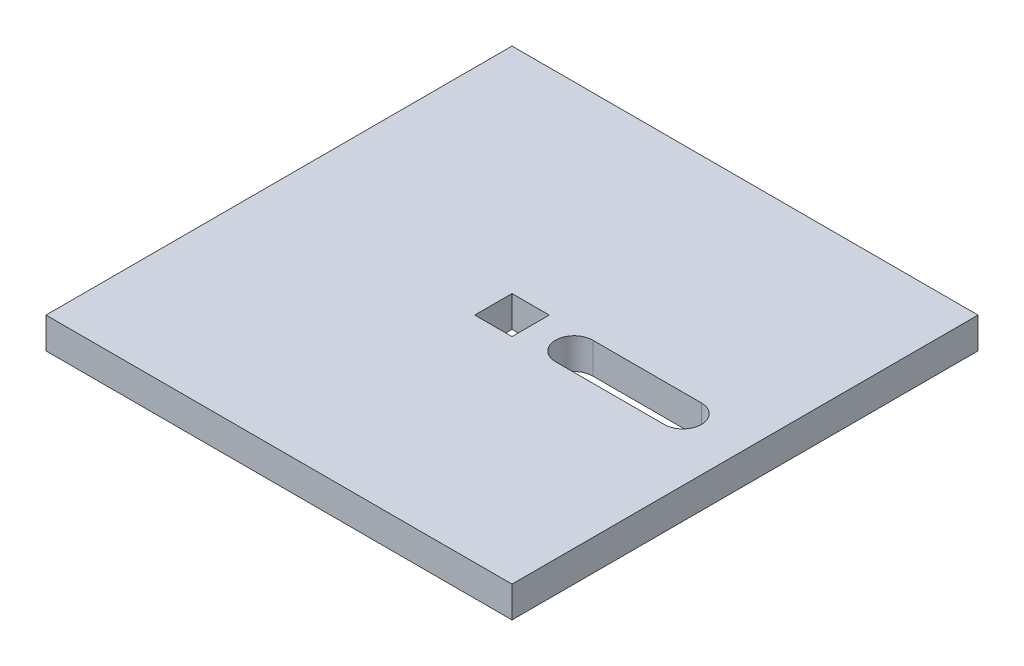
from build123d import *

# Parameters (mm, degrees)
SKETCH1_W           = 150
SKETCH1_H           = 150
BOSS_EXTRUDE1_DEPTH = 10
SKETCH3_W           = 12
SKETCH3_H           = 12
CUT_EXTRUDE2_DEPTH  = 107.536378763
CUT_EXTRUDE1_DEPTH  = 107.536378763


with BuildPart() as part:
    # Sketch1 → Boss-Extrude1 (new body)
    with BuildSketch(Plane(origin=(0, 0, 0), x_dir=(1, 0, 0), z_dir=(0, 1, 0))):
        Rectangle(SKETCH1_W, SKETCH1_H)
    extrude(amount=BOSS_EXTRUDE1_DEPTH)

    # Sketch3 → Cut-Extrude2 (cut, through all)
    with BuildSketch(Plane(origin=(0, 10, 0), x_dir=(1, 0, 0), z_dir=(0, 1, 0))):
        Rectangle(SKETCH3_W, SKETCH3_H)
    extrude(amount=-CUT_EXTRUDE2_DEPTH, mode=Mode.SUBTRACT)

    # Sketch2 → Cut-Extrude1 (cut, through all)
    with BuildSketch(Plane(origin=(0, 10, 0), x_dir=(1, 0, 0), z_dir=(0, 1, 0))):
        with BuildLine():
            Line((20, 6), (55, 6))
            ThreePointArc((55, 6), (61, 0), (55, -6))
            Line((55, -6), (20, -6))
            ThreePointArc((20, -6), (14, 0), (20, 6))
        make_face()
    extrude(amount=-CUT_EXTRUDE1_DEPTH, mode=Mode.SUBTRACT)


solid = part.part
